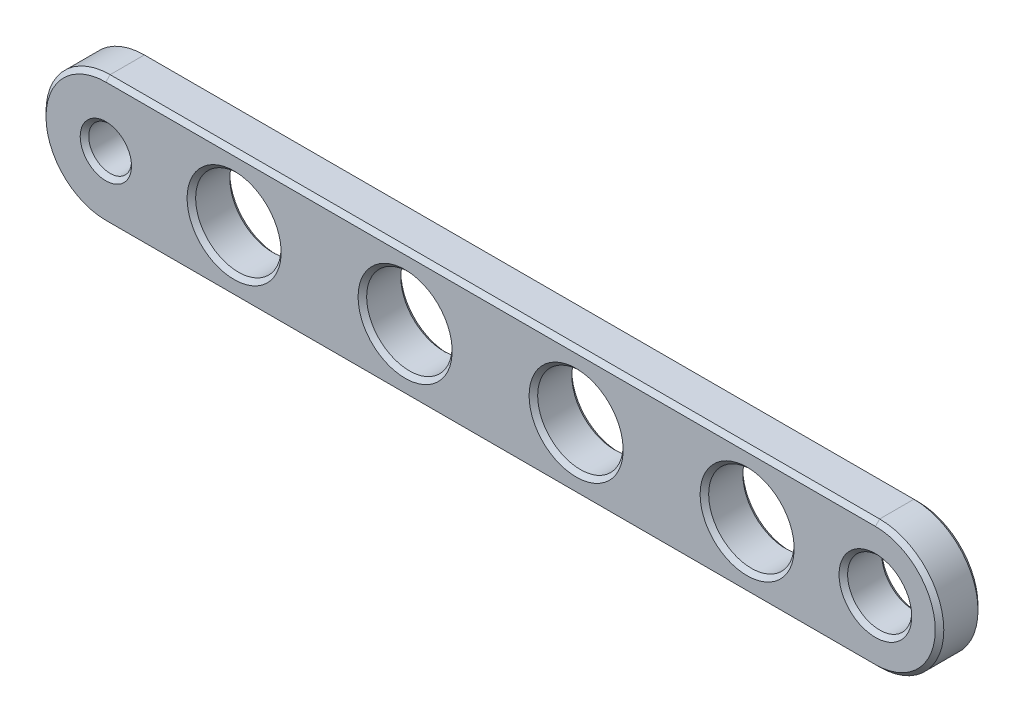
ISO-10303-21;
HEADER;
FILE_DESCRIPTION(('STEP AP214'),'2;1');
FILE_NAME('part.step','',(''),(''),'','','');
FILE_SCHEMA(('AUTOMOTIVE_DESIGN { 1 0 10303 214 1 1 1 1 }'));
ENDSEC;
DATA;
#1=APPLICATION_CONTEXT('core data for automotive mechanical design processes');
#2=APPLICATION_PROTOCOL_DEFINITION('international standard','automotive_design',2000,#1);
#3=PRODUCT_CONTEXT('',#1,'mechanical');
#4=PRODUCT('Part','Part','',(#3));
#5=PRODUCT_RELATED_PRODUCT_CATEGORY('part','',(#4));
#6=PRODUCT_DEFINITION_FORMATION('','',#4);
#7=PRODUCT_DEFINITION_CONTEXT('part definition',#1,'design');
#8=PRODUCT_DEFINITION('design','',#6,#7);
#9=PRODUCT_DEFINITION_SHAPE('','',#8);
#10=(LENGTH_UNIT() NAMED_UNIT(*) SI_UNIT(.MILLI.,.METRE.));
#11=(NAMED_UNIT(*) PLANE_ANGLE_UNIT() SI_UNIT($,.RADIAN.));
#12=(NAMED_UNIT(*) SI_UNIT($,.STERADIAN.) SOLID_ANGLE_UNIT());
#13=UNCERTAINTY_MEASURE_WITH_UNIT(LENGTH_MEASURE(1.E-05),#10,'distance_accuracy_value','');
#14=(GEOMETRIC_REPRESENTATION_CONTEXT(3) GLOBAL_UNCERTAINTY_ASSIGNED_CONTEXT((#13)) GLOBAL_UNIT_ASSIGNED_CONTEXT((#10,
#11,#12)) REPRESENTATION_CONTEXT('',''));
#15=CARTESIAN_POINT('',(0.,0.,0.));
#16=DIRECTION('',(0.,0.,1.));
#17=DIRECTION('',(1.,0.,0.));
#18=AXIS2_PLACEMENT_3D('',#15,#16,#17);
#19=CARTESIAN_POINT('',(18.6531645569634,0.,2.));
#20=DIRECTION('',(0.,0.,-1.));
#21=DIRECTION('',(-1.,0.,0.));
#22=AXIS2_PLACEMENT_3D('',#19,#20,#21);
#23=PLANE('',#22);
#24=CARTESIAN_POINT('',(12.6531645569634,0.,2.));
#25=DIRECTION('',(0.,0.,-1.));
#26=DIRECTION('',(-1.,0.,0.));
#27=AXIS2_PLACEMENT_3D('',#24,#25,#26);
#28=CIRCLE('',#27,2.19999999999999);
#29=CARTESIAN_POINT('',(10.4531645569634,0.,2.));
#30=VERTEX_POINT('',#29);
#31=EDGE_CURVE('E11',#30,#30,#28,.T.);
#32=ORIENTED_EDGE('',*,*,#31,.T.);
#33=EDGE_LOOP('',(#32));
#34=FACE_BOUND('',#33,.T.);
#35=CARTESIAN_POINT('',(4.65316455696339,0.,2.));
#36=DIRECTION('',(0.,0.,-1.));
#37=DIRECTION('',(-1.,0.,0.));
#38=AXIS2_PLACEMENT_3D('',#35,#36,#37);
#39=CIRCLE('',#38,2.19999999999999);
#40=CARTESIAN_POINT('',(2.4531645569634,0.,2.));
#41=VERTEX_POINT('',#40);
#42=EDGE_CURVE('E45',#41,#41,#39,.T.);
#43=ORIENTED_EDGE('',*,*,#42,.T.);
#44=EDGE_LOOP('',(#43));
#45=FACE_BOUND('',#44,.T.);
#46=CARTESIAN_POINT('',(-3.3468354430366,0.,2.));
#47=DIRECTION('',(0.,0.,-1.));
#48=DIRECTION('',(-1.,0.,0.));
#49=AXIS2_PLACEMENT_3D('',#46,#47,#48);
#50=CIRCLE('',#49,2.19999999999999);
#51=CARTESIAN_POINT('',(-5.5468354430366,0.,2.));
#52=VERTEX_POINT('',#51);
#53=EDGE_CURVE('E211',#52,#52,#50,.T.);
#54=ORIENTED_EDGE('',*,*,#53,.T.);
#55=EDGE_LOOP('',(#54));
#56=FACE_BOUND('',#55,.T.);
#57=CARTESIAN_POINT('',(-11.3468354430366,0.,2.));
#58=DIRECTION('',(0.,0.,-1.));
#59=DIRECTION('',(-1.,0.,0.));
#60=AXIS2_PLACEMENT_3D('',#57,#58,#59);
#61=CIRCLE('',#60,2.19999999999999);
#62=CARTESIAN_POINT('',(-13.5468354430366,0.,2.));
#63=VERTEX_POINT('',#62);
#64=EDGE_CURVE('E208',#63,#63,#61,.T.);
#65=ORIENTED_EDGE('',*,*,#64,.T.);
#66=EDGE_LOOP('',(#65));
#67=FACE_BOUND('',#66,.T.);
#68=CARTESIAN_POINT('',(18.6531645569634,0.,2.));
#69=DIRECTION('',(0.,0.,-1.));
#70=DIRECTION('',(-1.,0.,0.));
#71=AXIS2_PLACEMENT_3D('',#68,#69,#70);
#72=CIRCLE('',#71,1.69999999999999);
#73=CARTESIAN_POINT('',(16.9531645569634,0.,2.));
#74=VERTEX_POINT('',#73);
#75=EDGE_CURVE('E205',#74,#74,#72,.T.);
#76=ORIENTED_EDGE('',*,*,#75,.T.);
#77=EDGE_LOOP('',(#76));
#78=FACE_BOUND('',#77,.T.);
#79=CARTESIAN_POINT('',(-17.3468354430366,0.,2.));
#80=DIRECTION('',(0.,0.,-1.));
#81=DIRECTION('',(-1.,0.,0.));
#82=AXIS2_PLACEMENT_3D('',#79,#80,#81);
#83=CIRCLE('',#82,1.2);
#84=CARTESIAN_POINT('',(-18.5468354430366,0.,2.));
#85=VERTEX_POINT('',#84);
#86=EDGE_CURVE('E202',#85,#85,#83,.T.);
#87=ORIENTED_EDGE('',*,*,#86,.T.);
#88=EDGE_LOOP('',(#87));
#89=FACE_BOUND('',#88,.T.);
#90=CARTESIAN_POINT('',(-17.3468354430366,0.,2.));
#91=DIRECTION('',(0.,0.,-1.));
#92=DIRECTION('',(-1.,0.,0.));
#93=AXIS2_PLACEMENT_3D('',#90,#91,#92);
#94=CIRCLE('',#93,2.8);
#95=CARTESIAN_POINT('',(-17.3468354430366,2.8,2.));
#96=VERTEX_POINT('',#95);
#97=CARTESIAN_POINT('',(-17.3468354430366,-2.8,2.));
#98=VERTEX_POINT('',#97);
#99=EDGE_CURVE('E53',#96,#98,#94,.F.);
#100=ORIENTED_EDGE('',*,*,#99,.T.);
#101=DIRECTION('',(1.,0.,0.));
#102=VECTOR('',#101,1.);
#103=CARTESIAN_POINT('',(18.6531645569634,-2.8,2.));
#104=LINE('',#103,#102);
#105=CARTESIAN_POINT('',(18.6531645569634,-2.8,2.));
#106=VERTEX_POINT('',#105);
#107=EDGE_CURVE('E200',#98,#106,#104,.T.);
#108=ORIENTED_EDGE('',*,*,#107,.T.);
#109=CARTESIAN_POINT('',(18.6531645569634,0.,2.));
#110=DIRECTION('',(0.,0.,-1.));
#111=DIRECTION('',(-1.,0.,0.));
#112=AXIS2_PLACEMENT_3D('',#109,#110,#111);
#113=CIRCLE('',#112,2.8);
#114=CARTESIAN_POINT('',(18.6531645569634,2.8,2.));
#115=VERTEX_POINT('',#114);
#116=EDGE_CURVE('E196',#106,#115,#113,.F.);
#117=ORIENTED_EDGE('',*,*,#116,.T.);
#118=DIRECTION('',(-1.,0.,0.));
#119=VECTOR('',#118,1.);
#120=CARTESIAN_POINT('',(18.6531645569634,2.8,2.));
#121=LINE('',#120,#119);
#122=EDGE_CURVE('E58',#115,#96,#121,.T.);
#123=ORIENTED_EDGE('',*,*,#122,.T.);
#124=EDGE_LOOP('',(#100,#108,#117,#123));
#125=FACE_BOUND('',#124,.T.);
#126=ADVANCED_FACE('F35',(#34,#45,#56,#67,#78,#89,#125),#23,.F.);
#127=CARTESIAN_POINT('',(18.6531645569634,0.,0.));
#128=DIRECTION('',(0.,0.,-1.));
#129=DIRECTION('',(-1.,0.,0.));
#130=AXIS2_PLACEMENT_3D('',#127,#128,#129);
#131=PLANE('',#130);
#132=CARTESIAN_POINT('',(12.6531645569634,0.,0.));
#133=DIRECTION('',(0.,0.,-1.));
#134=DIRECTION('',(-1.,0.,0.));
#135=AXIS2_PLACEMENT_3D('',#132,#133,#134);
#136=CIRCLE('',#135,2.19999999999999);
#137=CARTESIAN_POINT('',(10.4531645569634,0.,0.));
#138=VERTEX_POINT('',#137);
#139=EDGE_CURVE('E141',#138,#138,#136,.F.);
#140=ORIENTED_EDGE('',*,*,#139,.T.);
#141=EDGE_LOOP('',(#140));
#142=FACE_BOUND('',#141,.T.);
#143=CARTESIAN_POINT('',(-3.3468354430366,0.,0.));
#144=DIRECTION('',(0.,0.,-1.));
#145=DIRECTION('',(-1.,0.,0.));
#146=AXIS2_PLACEMENT_3D('',#143,#144,#145);
#147=CIRCLE('',#146,2.2);
#148=CARTESIAN_POINT('',(-5.5468354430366,0.,0.));
#149=VERTEX_POINT('',#148);
#150=EDGE_CURVE('E134',#149,#149,#147,.F.);
#151=ORIENTED_EDGE('',*,*,#150,.T.);
#152=EDGE_LOOP('',(#151));
#153=FACE_BOUND('',#152,.T.);
#154=CARTESIAN_POINT('',(18.6531645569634,0.,0.));
#155=DIRECTION('',(0.,0.,-1.));
#156=DIRECTION('',(-1.,0.,0.));
#157=AXIS2_PLACEMENT_3D('',#154,#155,#156);
#158=CIRCLE('',#157,1.70000000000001);
#159=CARTESIAN_POINT('',(16.9531645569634,0.,0.));
#160=VERTEX_POINT('',#159);
#161=EDGE_CURVE('E131',#160,#160,#158,.F.);
#162=ORIENTED_EDGE('',*,*,#161,.T.);
#163=EDGE_LOOP('',(#162));
#164=FACE_BOUND('',#163,.T.);
#165=CARTESIAN_POINT('',(-17.3468354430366,0.,0.));
#166=DIRECTION('',(0.,0.,-1.));
#167=DIRECTION('',(-1.,0.,0.));
#168=AXIS2_PLACEMENT_3D('',#165,#166,#167);
#169=CIRCLE('',#168,2.8);
#170=CARTESIAN_POINT('',(-17.3468354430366,-2.80000000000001,0.));
#171=VERTEX_POINT('',#170);
#172=CARTESIAN_POINT('',(-17.3468354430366,2.8,0.));
#173=VERTEX_POINT('',#172);
#174=EDGE_CURVE('E130',#171,#173,#169,.T.);
#175=ORIENTED_EDGE('',*,*,#174,.T.);
#176=DIRECTION('',(1.,0.,0.));
#177=VECTOR('',#176,1.);
#178=CARTESIAN_POINT('',(18.6531645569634,2.8,0.));
#179=LINE('',#178,#177);
#180=CARTESIAN_POINT('',(18.6531645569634,2.8,0.));
#181=VERTEX_POINT('',#180);
#182=EDGE_CURVE('E108',#173,#181,#179,.T.);
#183=ORIENTED_EDGE('',*,*,#182,.T.);
#184=CARTESIAN_POINT('',(18.6531645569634,0.,0.));
#185=DIRECTION('',(0.,0.,-1.));
#186=DIRECTION('',(-1.,0.,0.));
#187=AXIS2_PLACEMENT_3D('',#184,#185,#186);
#188=CIRCLE('',#187,2.8);
#189=CARTESIAN_POINT('',(18.6531645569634,-2.80000000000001,0.));
#190=VERTEX_POINT('',#189);
#191=EDGE_CURVE('E118',#181,#190,#188,.T.);
#192=ORIENTED_EDGE('',*,*,#191,.T.);
#193=DIRECTION('',(-1.,0.,0.));
#194=VECTOR('',#193,1.);
#195=CARTESIAN_POINT('',(-17.3468354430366,-2.80000000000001,0.));
#196=LINE('',#195,#194);
#197=EDGE_CURVE('E124',#190,#171,#196,.T.);
#198=ORIENTED_EDGE('',*,*,#197,.T.);
#199=EDGE_LOOP('',(#175,#183,#192,#198));
#200=FACE_BOUND('',#199,.T.);
#201=CARTESIAN_POINT('',(-17.3468354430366,0.,0.));
#202=DIRECTION('',(0.,0.,-1.));
#203=DIRECTION('',(-1.,0.,0.));
#204=AXIS2_PLACEMENT_3D('',#201,#202,#203);
#205=CIRCLE('',#204,1.2);
#206=CARTESIAN_POINT('',(-18.5468354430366,0.,0.));
#207=VERTEX_POINT('',#206);
#208=EDGE_CURVE('E125',#207,#207,#205,.F.);
#209=ORIENTED_EDGE('',*,*,#208,.T.);
#210=EDGE_LOOP('',(#209));
#211=FACE_BOUND('',#210,.T.);
#212=CARTESIAN_POINT('',(-11.3468354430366,0.,0.));
#213=DIRECTION('',(0.,0.,-1.));
#214=DIRECTION('',(-1.,0.,0.));
#215=AXIS2_PLACEMENT_3D('',#212,#213,#214);
#216=CIRCLE('',#215,2.2);
#217=CARTESIAN_POINT('',(-13.5468354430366,0.,0.));
#218=VERTEX_POINT('',#217);
#219=EDGE_CURVE('E251',#218,#218,#216,.F.);
#220=ORIENTED_EDGE('',*,*,#219,.T.);
#221=EDGE_LOOP('',(#220));
#222=FACE_BOUND('',#221,.T.);
#223=CARTESIAN_POINT('',(4.65316455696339,0.,0.));
#224=DIRECTION('',(0.,0.,-1.));
#225=DIRECTION('',(-1.,0.,0.));
#226=AXIS2_PLACEMENT_3D('',#223,#224,#225);
#227=CIRCLE('',#226,2.2);
#228=CARTESIAN_POINT('',(2.4531645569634,0.,0.));
#229=VERTEX_POINT('',#228);
#230=EDGE_CURVE('E248',#229,#229,#227,.F.);
#231=ORIENTED_EDGE('',*,*,#230,.T.);
#232=EDGE_LOOP('',(#231));
#233=FACE_BOUND('',#232,.T.);
#234=ADVANCED_FACE('F127',(#142,#153,#164,#200,#211,#222,#233),#131,.T.);
#235=CARTESIAN_POINT('',(18.6531645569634,0.,2.));
#236=DIRECTION('',(0.,0.,-1.));
#237=DIRECTION('',(-1.,0.,0.));
#238=AXIS2_PLACEMENT_3D('',#235,#236,#237);
#239=CYLINDRICAL_SURFACE('',#238,3.);
#240=DIRECTION('',(0.,0.,-1.));
#241=VECTOR('',#240,1.);
#242=CARTESIAN_POINT('',(18.6531645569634,-3.,2.));
#243=LINE('',#242,#241);
#244=CARTESIAN_POINT('',(18.6531645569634,-3.,1.80000000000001));
#245=VERTEX_POINT('',#244);
#246=CARTESIAN_POINT('',(18.6531645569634,-3.,0.199999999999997));
#247=VERTEX_POINT('',#246);
#248=EDGE_CURVE('E220',#245,#247,#243,.T.);
#249=ORIENTED_EDGE('',*,*,#248,.T.);
#250=CARTESIAN_POINT('',(18.6531645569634,0.,0.199999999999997));
#251=DIRECTION('',(0.,0.,-1.));
#252=DIRECTION('',(-1.,0.,0.));
#253=AXIS2_PLACEMENT_3D('',#250,#251,#252);
#254=CIRCLE('',#253,3.);
#255=CARTESIAN_POINT('',(18.6531645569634,3.,0.199999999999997));
#256=VERTEX_POINT('',#255);
#257=EDGE_CURVE('E176',#247,#256,#254,.F.);
#258=ORIENTED_EDGE('',*,*,#257,.T.);
#259=DIRECTION('',(0.,0.,-1.));
#260=VECTOR('',#259,1.);
#261=CARTESIAN_POINT('',(18.6531645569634,3.,2.));
#262=LINE('',#261,#260);
#263=CARTESIAN_POINT('',(18.6531645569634,3.,1.80000000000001));
#264=VERTEX_POINT('',#263);
#265=EDGE_CURVE('E241',#264,#256,#262,.T.);
#266=ORIENTED_EDGE('',*,*,#265,.F.);
#267=CARTESIAN_POINT('',(18.6531645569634,0.,1.80000000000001));
#268=DIRECTION('',(0.,0.,-1.));
#269=DIRECTION('',(-1.,0.,0.));
#270=AXIS2_PLACEMENT_3D('',#267,#268,#269);
#271=CIRCLE('',#270,3.);
#272=EDGE_CURVE('E174',#264,#245,#271,.T.);
#273=ORIENTED_EDGE('',*,*,#272,.T.);
#274=EDGE_LOOP('',(#249,#258,#266,#273));
#275=FACE_BOUND('',#274,.T.);
#276=ADVANCED_FACE('F246',(#275),#239,.T.);
#277=CARTESIAN_POINT('',(-17.3468354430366,3.,2.));
#278=DIRECTION('',(0.,-1.,0.));
#279=DIRECTION('',(0.,0.,-1.));
#280=AXIS2_PLACEMENT_3D('',#277,#278,#279);
#281=PLANE('',#280);
#282=ORIENTED_EDGE('',*,*,#265,.T.);
#283=DIRECTION('',(-1.,0.,0.));
#284=VECTOR('',#283,1.);
#285=CARTESIAN_POINT('',(-17.3468354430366,3.,0.199999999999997));
#286=LINE('',#285,#284);
#287=CARTESIAN_POINT('',(-17.3468354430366,3.,0.199999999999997));
#288=VERTEX_POINT('',#287);
#289=EDGE_CURVE('E111',#256,#288,#286,.T.);
#290=ORIENTED_EDGE('',*,*,#289,.T.);
#291=DIRECTION('',(0.,0.,-1.));
#292=VECTOR('',#291,1.);
#293=CARTESIAN_POINT('',(-17.3468354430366,3.,2.));
#294=LINE('',#293,#292);
#295=CARTESIAN_POINT('',(-17.3468354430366,3.,1.80000000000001));
#296=VERTEX_POINT('',#295);
#297=EDGE_CURVE('E243',#296,#288,#294,.T.);
#298=ORIENTED_EDGE('',*,*,#297,.F.);
#299=DIRECTION('',(1.,0.,0.));
#300=VECTOR('',#299,1.);
#301=CARTESIAN_POINT('',(-17.3468354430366,3.,1.80000000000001));
#302=LINE('',#301,#300);
#303=EDGE_CURVE('E162',#296,#264,#302,.T.);
#304=ORIENTED_EDGE('',*,*,#303,.T.);
#305=EDGE_LOOP('',(#282,#290,#298,#304));
#306=FACE_BOUND('',#305,.T.);
#307=ADVANCED_FACE('F240',(#306),#281,.F.);
#308=CARTESIAN_POINT('',(-17.3468354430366,0.,2.));
#309=DIRECTION('',(0.,0.,-1.));
#310=DIRECTION('',(-1.,0.,0.));
#311=AXIS2_PLACEMENT_3D('',#308,#309,#310);
#312=CYLINDRICAL_SURFACE('',#311,3.);
#313=ORIENTED_EDGE('',*,*,#297,.T.);
#314=CARTESIAN_POINT('',(-17.3468354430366,0.,0.199999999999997));
#315=DIRECTION('',(0.,0.,-1.));
#316=DIRECTION('',(-1.,0.,0.));
#317=AXIS2_PLACEMENT_3D('',#314,#315,#316);
#318=CIRCLE('',#317,3.);
#319=CARTESIAN_POINT('',(-17.3468354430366,-3.,0.199999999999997));
#320=VERTEX_POINT('',#319);
#321=EDGE_CURVE('E167',#288,#320,#318,.F.);
#322=ORIENTED_EDGE('',*,*,#321,.T.);
#323=DIRECTION('',(0.,0.,-1.));
#324=VECTOR('',#323,1.);
#325=CARTESIAN_POINT('',(-17.3468354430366,-3.,2.));
#326=LINE('',#325,#324);
#327=CARTESIAN_POINT('',(-17.3468354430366,-3.,1.80000000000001));
#328=VERTEX_POINT('',#327);
#329=EDGE_CURVE('E253',#328,#320,#326,.T.);
#330=ORIENTED_EDGE('',*,*,#329,.F.);
#331=CARTESIAN_POINT('',(-17.3468354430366,0.,1.80000000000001));
#332=DIRECTION('',(0.,0.,-1.));
#333=DIRECTION('',(-1.,0.,0.));
#334=AXIS2_PLACEMENT_3D('',#331,#332,#333);
#335=CIRCLE('',#334,3.);
#336=EDGE_CURVE('E165',#328,#296,#335,.T.);
#337=ORIENTED_EDGE('',*,*,#336,.T.);
#338=EDGE_LOOP('',(#313,#322,#330,#337));
#339=FACE_BOUND('',#338,.T.);
#340=ADVANCED_FACE('F270',(#339),#312,.T.);
#341=CARTESIAN_POINT('',(-17.3468354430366,-3.,2.));
#342=DIRECTION('',(0.,1.,0.));
#343=DIRECTION('',(0.,0.,1.));
#344=AXIS2_PLACEMENT_3D('',#341,#342,#343);
#345=PLANE('',#344);
#346=ORIENTED_EDGE('',*,*,#329,.T.);
#347=DIRECTION('',(1.,0.,0.));
#348=VECTOR('',#347,1.);
#349=CARTESIAN_POINT('',(18.6531645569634,-3.,0.199999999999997));
#350=LINE('',#349,#348);
#351=EDGE_CURVE('E172',#320,#247,#350,.T.);
#352=ORIENTED_EDGE('',*,*,#351,.T.);
#353=ORIENTED_EDGE('',*,*,#248,.F.);
#354=DIRECTION('',(-1.,0.,0.));
#355=VECTOR('',#354,1.);
#356=CARTESIAN_POINT('',(-17.3468354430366,-3.,1.80000000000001));
#357=LINE('',#356,#355);
#358=EDGE_CURVE('E169',#245,#328,#357,.T.);
#359=ORIENTED_EDGE('',*,*,#358,.T.);
#360=EDGE_LOOP('',(#346,#352,#353,#359));
#361=FACE_BOUND('',#360,.T.);
#362=ADVANCED_FACE('F274',(#361),#345,.F.);
#363=CARTESIAN_POINT('',(-17.3468354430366,0.,2.));
#364=DIRECTION('',(0.,0.,-1.));
#365=DIRECTION('',(-1.,0.,0.));
#366=AXIS2_PLACEMENT_3D('',#363,#364,#365);
#367=CYLINDRICAL_SURFACE('',#366,1.);
#368=CARTESIAN_POINT('',(-17.3468354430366,0.,0.199999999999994));
#369=DIRECTION('',(0.,0.,-1.));
#370=DIRECTION('',(-1.,0.,0.));
#371=AXIS2_PLACEMENT_3D('',#368,#369,#370);
#372=CIRCLE('',#371,1.);
#373=CARTESIAN_POINT('',(-18.3468354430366,0.,0.199999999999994));
#374=VERTEX_POINT('',#373);
#375=EDGE_CURVE('E181',#374,#374,#372,.T.);
#376=ORIENTED_EDGE('',*,*,#375,.T.);
#377=EDGE_LOOP('',(#376));
#378=FACE_BOUND('',#377,.T.);
#379=CARTESIAN_POINT('',(-17.3468354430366,0.,1.8));
#380=DIRECTION('',(0.,0.,-1.));
#381=DIRECTION('',(-1.,0.,0.));
#382=AXIS2_PLACEMENT_3D('',#379,#380,#381);
#383=CIRCLE('',#382,1.);
#384=CARTESIAN_POINT('',(-18.3468354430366,0.,1.8));
#385=VERTEX_POINT('',#384);
#386=EDGE_CURVE('E178',#385,#385,#383,.F.);
#387=ORIENTED_EDGE('',*,*,#386,.T.);
#388=EDGE_LOOP('',(#387));
#389=FACE_BOUND('',#388,.T.);
#390=ADVANCED_FACE('F290',(#378,#389),#367,.F.);
#391=CARTESIAN_POINT('',(18.6531645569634,0.,2.));
#392=DIRECTION('',(0.,0.,-1.));
#393=DIRECTION('',(-1.,0.,0.));
#394=AXIS2_PLACEMENT_3D('',#391,#392,#393);
#395=CYLINDRICAL_SURFACE('',#394,1.5);
#396=CARTESIAN_POINT('',(18.6531645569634,0.,0.200000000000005));
#397=DIRECTION('',(0.,0.,-1.));
#398=DIRECTION('',(-1.,0.,0.));
#399=AXIS2_PLACEMENT_3D('',#396,#397,#398);
#400=CIRCLE('',#399,1.5);
#401=CARTESIAN_POINT('',(17.1531645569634,0.,0.200000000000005));
#402=VERTEX_POINT('',#401);
#403=EDGE_CURVE('E159',#402,#402,#400,.T.);
#404=CARTESIAN_POINT('',(18.6531645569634,0.,1.80000000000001));
#405=DIRECTION('',(0.,0.,-1.));
#406=DIRECTION('',(-1.,0.,0.));
#407=AXIS2_PLACEMENT_3D('',#404,#405,#406);
#408=CIRCLE('',#407,1.5);
#409=CARTESIAN_POINT('',(17.1531645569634,0.,1.80000000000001));
#410=VERTEX_POINT('',#409);
#411=EDGE_CURVE('E156',#410,#410,#408,.F.);
#412=CARTESIAN_POINT('',(17.1531645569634,0.,0.200000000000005));
#413=CARTESIAN_POINT('',(17.1531645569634,0.,0.216666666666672));
#414=CARTESIAN_POINT('',(17.1531645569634,0.,0.233333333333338));
#415=CARTESIAN_POINT('',(17.1531645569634,0.,0.266666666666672));
#416=CARTESIAN_POINT('',(17.1531645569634,0.,0.283333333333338));
#417=CARTESIAN_POINT('',(17.1531645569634,0.,0.316666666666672));
#418=CARTESIAN_POINT('',(17.1531645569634,0.,0.333333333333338));
#419=CARTESIAN_POINT('',(17.1531645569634,0.,0.366666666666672));
#420=CARTESIAN_POINT('',(17.1531645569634,0.,0.383333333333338));
#421=CARTESIAN_POINT('',(17.1531645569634,0.,0.416666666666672));
#422=CARTESIAN_POINT('',(17.1531645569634,0.,0.433333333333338));
#423=CARTESIAN_POINT('',(17.1531645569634,0.,0.466666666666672));
#424=CARTESIAN_POINT('',(17.1531645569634,0.,0.483333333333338));
#425=CARTESIAN_POINT('',(17.1531645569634,0.,0.516666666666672));
#426=CARTESIAN_POINT('',(17.1531645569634,0.,0.533333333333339));
#427=CARTESIAN_POINT('',(17.1531645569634,0.,0.566666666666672));
#428=CARTESIAN_POINT('',(17.1531645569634,0.,0.583333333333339));
#429=CARTESIAN_POINT('',(17.1531645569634,0.,0.616666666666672));
#430=CARTESIAN_POINT('',(17.1531645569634,0.,0.633333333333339));
#431=CARTESIAN_POINT('',(17.1531645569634,0.,0.666666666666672));
#432=CARTESIAN_POINT('',(17.1531645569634,0.,0.683333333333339));
#433=CARTESIAN_POINT('',(17.1531645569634,0.,0.716666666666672));
#434=CARTESIAN_POINT('',(17.1531645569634,0.,0.733333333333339));
#435=CARTESIAN_POINT('',(17.1531645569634,0.,0.766666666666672));
#436=CARTESIAN_POINT('',(17.1531645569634,0.,0.783333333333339));
#437=CARTESIAN_POINT('',(17.1531645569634,0.,0.816666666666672));
#438=CARTESIAN_POINT('',(17.1531645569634,0.,0.833333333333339));
#439=CARTESIAN_POINT('',(17.1531645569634,0.,0.866666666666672));
#440=CARTESIAN_POINT('',(17.1531645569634,0.,0.883333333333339));
#441=CARTESIAN_POINT('',(17.1531645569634,0.,0.916666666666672));
#442=CARTESIAN_POINT('',(17.1531645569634,0.,0.933333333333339));
#443=CARTESIAN_POINT('',(17.1531645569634,0.,0.966666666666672));
#444=CARTESIAN_POINT('',(17.1531645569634,0.,0.983333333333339));
#445=CARTESIAN_POINT('',(17.1531645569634,0.,1.01666666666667));
#446=CARTESIAN_POINT('',(17.1531645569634,0.,1.03333333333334));
#447=CARTESIAN_POINT('',(17.1531645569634,0.,1.06666666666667));
#448=CARTESIAN_POINT('',(17.1531645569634,0.,1.08333333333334));
#449=CARTESIAN_POINT('',(17.1531645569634,0.,1.11666666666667));
#450=CARTESIAN_POINT('',(17.1531645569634,0.,1.13333333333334));
#451=CARTESIAN_POINT('',(17.1531645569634,0.,1.16666666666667));
#452=CARTESIAN_POINT('',(17.1531645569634,0.,1.18333333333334));
#453=CARTESIAN_POINT('',(17.1531645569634,0.,1.21666666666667));
#454=CARTESIAN_POINT('',(17.1531645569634,0.,1.23333333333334));
#455=CARTESIAN_POINT('',(17.1531645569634,0.,1.26666666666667));
#456=CARTESIAN_POINT('',(17.1531645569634,0.,1.28333333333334));
#457=CARTESIAN_POINT('',(17.1531645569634,0.,1.31666666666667));
#458=CARTESIAN_POINT('',(17.1531645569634,0.,1.33333333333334));
#459=CARTESIAN_POINT('',(17.1531645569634,0.,1.36666666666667));
#460=CARTESIAN_POINT('',(17.1531645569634,0.,1.38333333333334));
#461=CARTESIAN_POINT('',(17.1531645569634,0.,1.41666666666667));
#462=CARTESIAN_POINT('',(17.1531645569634,0.,1.43333333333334));
#463=CARTESIAN_POINT('',(17.1531645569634,0.,1.46666666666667));
#464=CARTESIAN_POINT('',(17.1531645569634,0.,1.48333333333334));
#465=CARTESIAN_POINT('',(17.1531645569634,0.,1.51666666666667));
#466=CARTESIAN_POINT('',(17.1531645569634,0.,1.53333333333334));
#467=CARTESIAN_POINT('',(17.1531645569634,0.,1.56666666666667));
#468=CARTESIAN_POINT('',(17.1531645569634,0.,1.58333333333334));
#469=CARTESIAN_POINT('',(17.1531645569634,0.,1.61666666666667));
#470=CARTESIAN_POINT('',(17.1531645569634,0.,1.63333333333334));
#471=CARTESIAN_POINT('',(17.1531645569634,0.,1.66666666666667));
#472=CARTESIAN_POINT('',(17.1531645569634,0.,1.68333333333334));
#473=CARTESIAN_POINT('',(17.1531645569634,0.,1.71666666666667));
#474=CARTESIAN_POINT('',(17.1531645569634,0.,1.73333333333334));
#475=CARTESIAN_POINT('',(17.1531645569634,0.,1.76666666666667));
#476=CARTESIAN_POINT('',(17.1531645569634,0.,1.78333333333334));
#477=CARTESIAN_POINT('',(17.1531645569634,0.,1.80000000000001));
#478=B_SPLINE_CURVE_WITH_KNOTS('',3,(#412,#413,#414,#415,#416,#417,#418,#419,#420,#421,#422,
#423,#424,#425,#426,#427,#428,#429,#430,#431,#432,#433,#434,#435,#436,#437,#438,#439,#440,#441,
#442,#443,#444,#445,#446,#447,#448,#449,#450,#451,#452,#453,#454,#455,#456,#457,#458,#459,#460,
#461,#462,#463,#464,#465,#466,#467,#468,#469,#470,#471,#472,#473,#474,#475,#476,#477),
.UNSPECIFIED.,.F.,.F.,(4,2,2,2,2,2,2,2,2,2,2,2,2,2,2,2,2,2,2,2,2,2,2,2,2,2,2,2,2,2,2,2,4),(0.,
0.0500000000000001,0.1,0.15,0.2,0.25,0.3,0.35,0.4,0.45,0.5,0.550000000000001,0.600000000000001,
0.650000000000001,0.700000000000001,0.750000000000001,0.800000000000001,0.850000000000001,
0.900000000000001,0.950000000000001,1.,1.05,1.1,1.15,1.2,1.25,1.3,1.35,1.4,1.45,1.5,1.55,1.6),.UNSPECIFIED.);
#479=EDGE_CURVE('BSEAM518',#402,#410,#478,.T.);
#480=ORIENTED_EDGE('',*,*,#403,.T.);
#481=ORIENTED_EDGE('',*,*,#411,.T.);
#482=ORIENTED_EDGE('',*,*,#479,.T.);
#483=ORIENTED_EDGE('',*,*,#479,.F.);
#484=EDGE_LOOP('',(#480,#482,#481,#483));
#485=FACE_BOUND('',#484,.T.);
#486=ADVANCED_FACE('F518',(#485),#395,.F.);
#487=CARTESIAN_POINT('',(-11.3468354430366,0.,2.));
#488=DIRECTION('',(0.,0.,-1.));
#489=DIRECTION('',(-1.,0.,0.));
#490=AXIS2_PLACEMENT_3D('',#487,#488,#489);
#491=CYLINDRICAL_SURFACE('',#490,2.);
#492=CARTESIAN_POINT('',(-11.3468354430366,0.,0.200000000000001));
#493=DIRECTION('',(0.,0.,-1.));
#494=DIRECTION('',(-1.,0.,0.));
#495=AXIS2_PLACEMENT_3D('',#492,#493,#494);
#496=CIRCLE('',#495,2.);
#497=CARTESIAN_POINT('',(-13.3468354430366,0.,0.200000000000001));
#498=VERTEX_POINT('',#497);
#499=EDGE_CURVE('E187',#498,#498,#496,.T.);
#500=ORIENTED_EDGE('',*,*,#499,.T.);
#501=EDGE_LOOP('',(#500));
#502=FACE_BOUND('',#501,.T.);
#503=CARTESIAN_POINT('',(-11.3468354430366,0.,1.80000000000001));
#504=DIRECTION('',(0.,0.,-1.));
#505=DIRECTION('',(-1.,0.,0.));
#506=AXIS2_PLACEMENT_3D('',#503,#504,#505);
#507=CIRCLE('',#506,2.);
#508=CARTESIAN_POINT('',(-13.3468354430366,0.,1.80000000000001));
#509=VERTEX_POINT('',#508);
#510=EDGE_CURVE('E184',#509,#509,#507,.F.);
#511=ORIENTED_EDGE('',*,*,#510,.T.);
#512=EDGE_LOOP('',(#511));
#513=FACE_BOUND('',#512,.T.);
#514=ADVANCED_FACE('F510',(#502,#513),#491,.F.);
#515=CARTESIAN_POINT('',(-3.3468354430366,0.,2.));
#516=DIRECTION('',(0.,0.,-1.));
#517=DIRECTION('',(-1.,0.,0.));
#518=AXIS2_PLACEMENT_3D('',#515,#516,#517);
#519=CYLINDRICAL_SURFACE('',#518,2.);
#520=CARTESIAN_POINT('',(-3.3468354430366,0.,0.199999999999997));
#521=DIRECTION('',(0.,0.,-1.));
#522=DIRECTION('',(-1.,0.,0.));
#523=AXIS2_PLACEMENT_3D('',#520,#521,#522);
#524=CIRCLE('',#523,2.);
#525=CARTESIAN_POINT('',(-5.3468354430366,0.,0.199999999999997));
#526=VERTEX_POINT('',#525);
#527=EDGE_CURVE('E153',#526,#526,#524,.T.);
#528=ORIENTED_EDGE('',*,*,#527,.T.);
#529=EDGE_LOOP('',(#528));
#530=FACE_BOUND('',#529,.T.);
#531=CARTESIAN_POINT('',(-3.3468354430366,0.,1.80000000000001));
#532=DIRECTION('',(0.,0.,-1.));
#533=DIRECTION('',(-1.,0.,0.));
#534=AXIS2_PLACEMENT_3D('',#531,#532,#533);
#535=CIRCLE('',#534,2.);
#536=CARTESIAN_POINT('',(-5.3468354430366,0.,1.80000000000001));
#537=VERTEX_POINT('',#536);
#538=EDGE_CURVE('E150',#537,#537,#535,.F.);
#539=ORIENTED_EDGE('',*,*,#538,.T.);
#540=EDGE_LOOP('',(#539));
#541=FACE_BOUND('',#540,.T.);
#542=ADVANCED_FACE('F502',(#530,#541),#519,.F.);
#543=CARTESIAN_POINT('',(4.65316455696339,0.,2.));
#544=DIRECTION('',(0.,0.,-1.));
#545=DIRECTION('',(-1.,0.,0.));
#546=AXIS2_PLACEMENT_3D('',#543,#544,#545);
#547=CYLINDRICAL_SURFACE('',#546,2.);
#548=CARTESIAN_POINT('',(4.65316455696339,0.,0.199999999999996));
#549=DIRECTION('',(0.,0.,-1.));
#550=DIRECTION('',(-1.,0.,0.));
#551=AXIS2_PLACEMENT_3D('',#548,#549,#550);
#552=CIRCLE('',#551,2.);
#553=CARTESIAN_POINT('',(2.65316455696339,0.,0.199999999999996));
#554=VERTEX_POINT('',#553);
#555=EDGE_CURVE('E193',#554,#554,#552,.T.);
#556=ORIENTED_EDGE('',*,*,#555,.T.);
#557=EDGE_LOOP('',(#556));
#558=FACE_BOUND('',#557,.T.);
#559=CARTESIAN_POINT('',(4.65316455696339,0.,1.80000000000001));
#560=DIRECTION('',(0.,0.,-1.));
#561=DIRECTION('',(-1.,0.,0.));
#562=AXIS2_PLACEMENT_3D('',#559,#560,#561);
#563=CIRCLE('',#562,2.);
#564=CARTESIAN_POINT('',(2.65316455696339,0.,1.80000000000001));
#565=VERTEX_POINT('',#564);
#566=EDGE_CURVE('E190',#565,#565,#563,.F.);
#567=ORIENTED_EDGE('',*,*,#566,.T.);
#568=EDGE_LOOP('',(#567));
#569=FACE_BOUND('',#568,.T.);
#570=ADVANCED_FACE('F494',(#558,#569),#547,.F.);
#571=CARTESIAN_POINT('',(12.6531645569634,0.,2.));
#572=DIRECTION('',(0.,0.,-1.));
#573=DIRECTION('',(-1.,0.,0.));
#574=AXIS2_PLACEMENT_3D('',#571,#572,#573);
#575=CYLINDRICAL_SURFACE('',#574,2.);
#576=CARTESIAN_POINT('',(12.6531645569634,0.,0.199999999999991));
#577=DIRECTION('',(0.,0.,-1.));
#578=DIRECTION('',(-1.,0.,0.));
#579=AXIS2_PLACEMENT_3D('',#576,#577,#578);
#580=CIRCLE('',#579,2.);
#581=CARTESIAN_POINT('',(10.6531645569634,0.,0.199999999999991));
#582=VERTEX_POINT('',#581);
#583=EDGE_CURVE('E147',#582,#582,#580,.T.);
#584=ORIENTED_EDGE('',*,*,#583,.T.);
#585=EDGE_LOOP('',(#584));
#586=FACE_BOUND('',#585,.T.);
#587=CARTESIAN_POINT('',(12.6531645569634,0.,1.80000000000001));
#588=DIRECTION('',(0.,0.,-1.));
#589=DIRECTION('',(-1.,0.,0.));
#590=AXIS2_PLACEMENT_3D('',#587,#588,#589);
#591=CIRCLE('',#590,2.);
#592=CARTESIAN_POINT('',(10.6531645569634,0.,1.80000000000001));
#593=VERTEX_POINT('',#592);
#594=EDGE_CURVE('E144',#593,#593,#591,.F.);
#595=ORIENTED_EDGE('',*,*,#594,.T.);
#596=EDGE_LOOP('',(#595));
#597=FACE_BOUND('',#596,.T.);
#598=ADVANCED_FACE('F309',(#586,#597),#575,.F.);
#599=CARTESIAN_POINT('',(12.6531645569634,0.,0.));
#600=DIRECTION('',(0.,0.,-1.));
#601=DIRECTION('',(-1.,0.,0.));
#602=AXIS2_PLACEMENT_3D('',#599,#600,#601);
#603=CONICAL_SURFACE('',#602,2.19999999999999,0.785398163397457);
#604=ORIENTED_EDGE('',*,*,#583,.F.);
#605=EDGE_LOOP('',(#604));
#606=FACE_BOUND('',#605,.T.);
#607=ORIENTED_EDGE('',*,*,#139,.F.);
#608=EDGE_LOOP('',(#607));
#609=FACE_BOUND('',#608,.T.);
#610=ADVANCED_FACE('F302',(#606,#609),#603,.F.);
#611=CARTESIAN_POINT('',(-3.3468354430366,0.,0.));
#612=DIRECTION('',(0.,0.,-1.));
#613=DIRECTION('',(-1.,0.,0.));
#614=AXIS2_PLACEMENT_3D('',#611,#612,#613);
#615=CONICAL_SURFACE('',#614,2.2,0.785398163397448);
#616=ORIENTED_EDGE('',*,*,#527,.F.);
#617=EDGE_LOOP('',(#616));
#618=FACE_BOUND('',#617,.T.);
#619=ORIENTED_EDGE('',*,*,#150,.F.);
#620=EDGE_LOOP('',(#619));
#621=FACE_BOUND('',#620,.T.);
#622=ADVANCED_FACE('F308',(#618,#621),#615,.F.);
#623=CARTESIAN_POINT('',(18.6531645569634,0.,0.));
#624=DIRECTION('',(0.,0.,-1.));
#625=DIRECTION('',(-1.,0.,0.));
#626=AXIS2_PLACEMENT_3D('',#623,#624,#625);
#627=CONICAL_SURFACE('',#626,1.70000000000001,0.785398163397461);
#628=CARTESIAN_POINT('',(17.1531645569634,0.,0.200000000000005));
#629=CARTESIAN_POINT('',(17.1510812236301,0.,0.197916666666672));
#630=CARTESIAN_POINT('',(17.1489978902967,0.,0.195833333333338));
#631=CARTESIAN_POINT('',(17.1448312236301,0.,0.191666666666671));
#632=CARTESIAN_POINT('',(17.1427478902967,0.,0.189583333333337));
#633=CARTESIAN_POINT('',(17.1385812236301,0.,0.185416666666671));
#634=CARTESIAN_POINT('',(17.1364978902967,0.,0.183333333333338));
#635=CARTESIAN_POINT('',(17.1323312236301,0.,0.179166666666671));
#636=CARTESIAN_POINT('',(17.1302478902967,0.,0.177083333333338));
#637=CARTESIAN_POINT('',(17.1260812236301,0.,0.172916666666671));
#638=CARTESIAN_POINT('',(17.1239978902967,0.,0.170833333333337));
#639=CARTESIAN_POINT('',(17.1198312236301,0.,0.16666666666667));
#640=CARTESIAN_POINT('',(17.1177478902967,0.,0.164583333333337));
#641=CARTESIAN_POINT('',(17.1135812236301,0.,0.16041666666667));
#642=CARTESIAN_POINT('',(17.1114978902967,0.,0.158333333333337));
#643=CARTESIAN_POINT('',(17.1073312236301,0.,0.154166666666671));
#644=CARTESIAN_POINT('',(17.1052478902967,0.,0.152083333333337));
#645=CARTESIAN_POINT('',(17.1010812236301,0.,0.14791666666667));
#646=CARTESIAN_POINT('',(17.0989978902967,0.,0.145833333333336));
#647=CARTESIAN_POINT('',(17.0948312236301,0.,0.14166666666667));
#648=CARTESIAN_POINT('',(17.0927478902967,0.,0.139583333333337));
#649=CARTESIAN_POINT('',(17.0885812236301,0.,0.13541666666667));
#650=CARTESIAN_POINT('',(17.0864978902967,0.,0.133333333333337));
#651=CARTESIAN_POINT('',(17.0823312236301,0.,0.129166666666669));
#652=CARTESIAN_POINT('',(17.0802478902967,0.,0.127083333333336));
#653=CARTESIAN_POINT('',(17.0760812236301,0.,0.122916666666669));
#654=CARTESIAN_POINT('',(17.0739978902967,0.,0.120833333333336));
#655=CARTESIAN_POINT('',(17.0698312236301,0.,0.11666666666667));
#656=CARTESIAN_POINT('',(17.0677478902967,0.,0.114583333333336));
#657=CARTESIAN_POINT('',(17.0635812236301,0.,0.110416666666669));
#658=CARTESIAN_POINT('',(17.0614978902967,0.,0.108333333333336));
#659=CARTESIAN_POINT('',(17.0573312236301,0.,0.104166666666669));
#660=CARTESIAN_POINT('',(17.0552478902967,0.,0.102083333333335));
#661=CARTESIAN_POINT('',(17.0510812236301,0.,0.0979166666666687));
#662=CARTESIAN_POINT('',(17.0489978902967,0.,0.0958333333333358));
#663=CARTESIAN_POINT('',(17.0448312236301,0.,0.0916666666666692));
#664=CARTESIAN_POINT('',(17.0427478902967,0.,0.0895833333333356));
#665=CARTESIAN_POINT('',(17.0385812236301,0.,0.0854166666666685));
#666=CARTESIAN_POINT('',(17.0364978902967,0.,0.0833333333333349));
#667=CARTESIAN_POINT('',(17.0323312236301,0.,0.0791666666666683));
#668=CARTESIAN_POINT('',(17.0302478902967,0.,0.0770833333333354));
#669=CARTESIAN_POINT('',(17.0260812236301,0.,0.0729166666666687));
#670=CARTESIAN_POINT('',(17.0239978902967,0.,0.0708333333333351));
#671=CARTESIAN_POINT('',(17.0198312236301,0.,0.0666666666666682));
#672=CARTESIAN_POINT('',(17.0177478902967,0.,0.0645833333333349));
#673=CARTESIAN_POINT('',(17.0135812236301,0.,0.060416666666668));
#674=CARTESIAN_POINT('',(17.0114978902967,0.,0.0583333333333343));
#675=CARTESIAN_POINT('',(17.0073312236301,0.,0.0541666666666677));
#676=CARTESIAN_POINT('',(17.0052478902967,0.,0.0520833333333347));
#677=CARTESIAN_POINT('',(17.0010812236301,0.,0.0479166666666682));
#678=CARTESIAN_POINT('',(16.9989978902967,0.,0.0458333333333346));
#679=CARTESIAN_POINT('',(16.9948312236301,0.,0.0416666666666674));
#680=CARTESIAN_POINT('',(16.9927478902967,0.,0.0395833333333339));
#681=CARTESIAN_POINT('',(16.9885812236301,0.,0.0354166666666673));
#682=CARTESIAN_POINT('',(16.9864978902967,0.,0.0333333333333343));
#683=CARTESIAN_POINT('',(16.9823312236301,0.,0.0291666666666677));
#684=CARTESIAN_POINT('',(16.9802478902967,0.,0.027083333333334));
#685=CARTESIAN_POINT('',(16.9760812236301,0.,0.0229166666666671));
#686=CARTESIAN_POINT('',(16.9739978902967,0.,0.0208333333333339));
#687=CARTESIAN_POINT('',(16.9698312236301,0.,0.016666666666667));
#688=CARTESIAN_POINT('',(16.9677478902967,0.,0.0145833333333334));
#689=CARTESIAN_POINT('',(16.9635812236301,0.,0.0104166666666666));
#690=CARTESIAN_POINT('',(16.9614978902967,0.,0.00833333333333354));
#691=CARTESIAN_POINT('',(16.95733122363,0.,0.00416666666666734));
#692=CARTESIAN_POINT('',(16.9552478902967,0.,0.00208333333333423));
#693=CARTESIAN_POINT('',(16.9531645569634,0.,0.));
#694=B_SPLINE_CURVE_WITH_KNOTS('',3,(#628,#629,#630,#631,#632,#633,#634,#635,#636,#637,#638,
#639,#640,#641,#642,#643,#644,#645,#646,#647,#648,#649,#650,#651,#652,#653,#654,#655,#656,#657,
#658,#659,#660,#661,#662,#663,#664,#665,#666,#667,#668,#669,#670,#671,#672,#673,#674,#675,#676,
#677,#678,#679,#680,#681,#682,#683,#684,#685,#686,#687,#688,#689,#690,#691,#692,#693),
.UNSPECIFIED.,.F.,.F.,(4,2,2,2,2,2,2,2,2,2,2,2,2,2,2,2,2,2,2,2,2,2,2,2,2,2,2,2,2,2,2,2,4),(0.,
0.00883883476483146,0.0176776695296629,0.0265165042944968,0.0353553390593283,0.0441941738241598,
0.0530330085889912,0.0618718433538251,0.0707106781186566,0.079549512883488,0.088388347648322,
0.0972271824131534,0.106066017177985,0.114904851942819,0.12374368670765,0.132582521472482,
0.141421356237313,0.150260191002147,0.159099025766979,0.16793786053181,0.176776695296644,
0.185615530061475,0.194454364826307,0.203293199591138,0.212132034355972,0.220970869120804,
0.229809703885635,0.238648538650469,0.247487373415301,0.256326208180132,0.265165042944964,
0.274003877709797,0.282842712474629),.UNSPECIFIED.);
#695=EDGE_CURVE('BSEAM316',#402,#160,#694,.T.);
#696=ORIENTED_EDGE('',*,*,#403,.F.);
#697=ORIENTED_EDGE('',*,*,#161,.F.);
#698=ORIENTED_EDGE('',*,*,#695,.T.);
#699=ORIENTED_EDGE('',*,*,#695,.F.);
#700=EDGE_LOOP('',(#696,#698,#697,#699));
#701=FACE_BOUND('',#700,.T.);
#702=ADVANCED_FACE('F316',(#701),#627,.F.);
#703=CARTESIAN_POINT('',(-17.3468354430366,-3.,0.199999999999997));
#704=DIRECTION('',(0.,-0.70710678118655,-0.707106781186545));
#705=DIRECTION('',(-1.,0.,0.));
#706=AXIS2_PLACEMENT_3D('',#703,#704,#705);
#707=PLANE('',#706);
#708=DIRECTION('',(0.,-0.707106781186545,0.70710678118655));
#709=VECTOR('',#708,1.);
#710=CARTESIAN_POINT('',(-17.3468354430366,-2.80000000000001,0.));
#711=LINE('',#710,#709);
#712=EDGE_CURVE('E114',#171,#320,#711,.T.);
#713=ORIENTED_EDGE('',*,*,#712,.F.);
#714=ORIENTED_EDGE('',*,*,#197,.F.);
#715=DIRECTION('',(0.,0.707106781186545,-0.70710678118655));
#716=VECTOR('',#715,1.);
#717=CARTESIAN_POINT('',(18.6531645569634,-3.,0.199999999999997));
#718=LINE('',#717,#716);
#719=EDGE_CURVE('E121',#247,#190,#718,.T.);
#720=ORIENTED_EDGE('',*,*,#719,.F.);
#721=ORIENTED_EDGE('',*,*,#351,.F.);
#722=EDGE_LOOP('',(#713,#714,#720,#721));
#723=FACE_BOUND('',#722,.T.);
#724=ADVANCED_FACE('F263',(#723),#707,.T.);
#725=CARTESIAN_POINT('',(18.6531645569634,0.,0.199999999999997));
#726=DIRECTION('',(0.,0.,1.));
#727=DIRECTION('',(1.,0.,0.));
#728=AXIS2_PLACEMENT_3D('',#725,#726,#727);
#729=CONICAL_SURFACE('',#728,3.,0.785398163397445);
#730=ORIENTED_EDGE('',*,*,#719,.T.);
#731=ORIENTED_EDGE('',*,*,#191,.F.);
#732=DIRECTION('',(0.,-0.707106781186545,-0.70710678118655));
#733=VECTOR('',#732,1.);
#734=CARTESIAN_POINT('',(18.6531645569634,3.,0.199999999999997));
#735=LINE('',#734,#733);
#736=EDGE_CURVE('E104',#256,#181,#735,.T.);
#737=ORIENTED_EDGE('',*,*,#736,.F.);
#738=ORIENTED_EDGE('',*,*,#257,.F.);
#739=EDGE_LOOP('',(#730,#731,#737,#738));
#740=FACE_BOUND('',#739,.T.);
#741=ADVANCED_FACE('F119',(#740),#729,.T.);
#742=CARTESIAN_POINT('',(-17.3468354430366,0.,0.199999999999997));
#743=DIRECTION('',(0.,0.,1.));
#744=DIRECTION('',(1.,0.,0.));
#745=AXIS2_PLACEMENT_3D('',#742,#743,#744);
#746=CONICAL_SURFACE('',#745,3.,0.785398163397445);
#747=ORIENTED_EDGE('',*,*,#712,.T.);
#748=ORIENTED_EDGE('',*,*,#321,.F.);
#749=DIRECTION('',(0.,0.707106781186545,0.70710678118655));
#750=VECTOR('',#749,1.);
#751=CARTESIAN_POINT('',(-17.3468354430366,2.8,0.));
#752=LINE('',#751,#750);
#753=EDGE_CURVE('E115',#173,#288,#752,.T.);
#754=ORIENTED_EDGE('',*,*,#753,.F.);
#755=ORIENTED_EDGE('',*,*,#174,.F.);
#756=EDGE_LOOP('',(#747,#748,#754,#755));
#757=FACE_BOUND('',#756,.T.);
#758=ADVANCED_FACE('F266',(#757),#746,.T.);
#759=CARTESIAN_POINT('',(-17.3468354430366,3.,0.199999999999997));
#760=DIRECTION('',(0.,0.70710678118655,-0.707106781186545));
#761=DIRECTION('',(1.,0.,0.));
#762=AXIS2_PLACEMENT_3D('',#759,#760,#761);
#763=PLANE('',#762);
#764=ORIENTED_EDGE('',*,*,#736,.T.);
#765=ORIENTED_EDGE('',*,*,#182,.F.);
#766=ORIENTED_EDGE('',*,*,#753,.T.);
#767=ORIENTED_EDGE('',*,*,#289,.F.);
#768=EDGE_LOOP('',(#764,#765,#766,#767));
#769=FACE_BOUND('',#768,.T.);
#770=ADVANCED_FACE('F106',(#769),#763,.T.);
#771=CARTESIAN_POINT('',(-17.3468354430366,0.,0.));
#772=DIRECTION('',(0.,0.,-1.));
#773=DIRECTION('',(-1.,0.,0.));
#774=AXIS2_PLACEMENT_3D('',#771,#772,#773);
#775=CONICAL_SURFACE('',#774,1.2,0.785398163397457);
#776=CARTESIAN_POINT('',(-18.3468354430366,0.,0.199999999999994));
#777=CARTESIAN_POINT('',(-18.3489187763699,0.,0.19791666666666));
#778=CARTESIAN_POINT('',(-18.3510021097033,0.,0.195833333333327));
#779=CARTESIAN_POINT('',(-18.3551687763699,0.,0.191666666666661));
#780=CARTESIAN_POINT('',(-18.3572521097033,0.,0.189583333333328));
#781=CARTESIAN_POINT('',(-18.3614187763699,0.,0.185416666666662));
#782=CARTESIAN_POINT('',(-18.3635021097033,0.,0.183333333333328));
#783=CARTESIAN_POINT('',(-18.3676687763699,0.,0.179166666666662));
#784=CARTESIAN_POINT('',(-18.3697521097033,0.,0.177083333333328));
#785=CARTESIAN_POINT('',(-18.3739187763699,0.,0.172916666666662));
#786=CARTESIAN_POINT('',(-18.3760021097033,0.,0.170833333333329));
#787=CARTESIAN_POINT('',(-18.3801687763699,0.,0.166666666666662));
#788=CARTESIAN_POINT('',(-18.3822521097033,0.,0.164583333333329));
#789=CARTESIAN_POINT('',(-18.3864187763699,0.,0.160416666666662));
#790=CARTESIAN_POINT('',(-18.3885021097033,0.,0.158333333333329));
#791=CARTESIAN_POINT('',(-18.3926687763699,0.,0.154166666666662));
#792=CARTESIAN_POINT('',(-18.3947521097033,0.,0.152083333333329));
#793=CARTESIAN_POINT('',(-18.3989187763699,0.,0.147916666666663));
#794=CARTESIAN_POINT('',(-18.4010021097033,0.,0.145833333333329));
#795=CARTESIAN_POINT('',(-18.4051687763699,0.,0.141666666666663));
#796=CARTESIAN_POINT('',(-18.4072521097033,0.,0.139583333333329));
#797=CARTESIAN_POINT('',(-18.4114187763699,0.,0.135416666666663));
#798=CARTESIAN_POINT('',(-18.4135021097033,0.,0.13333333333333));
#799=CARTESIAN_POINT('',(-18.4176687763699,0.,0.129166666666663));
#800=CARTESIAN_POINT('',(-18.4197521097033,0.,0.127083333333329));
#801=CARTESIAN_POINT('',(-18.4239187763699,0.,0.122916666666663));
#802=CARTESIAN_POINT('',(-18.4260021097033,0.,0.12083333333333));
#803=CARTESIAN_POINT('',(-18.4301687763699,0.,0.116666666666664));
#804=CARTESIAN_POINT('',(-18.4322521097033,0.,0.11458333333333));
#805=CARTESIAN_POINT('',(-18.4364187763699,0.,0.110416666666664));
#806=CARTESIAN_POINT('',(-18.4385021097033,0.,0.10833333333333));
#807=CARTESIAN_POINT('',(-18.4426687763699,0.,0.104166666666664));
#808=CARTESIAN_POINT('',(-18.4447521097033,0.,0.10208333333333));
#809=CARTESIAN_POINT('',(-18.4489187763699,0.,0.097916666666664));
#810=CARTESIAN_POINT('',(-18.4510021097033,0.,0.0958333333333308));
#811=CARTESIAN_POINT('',(-18.4551687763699,0.,0.091666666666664));
#812=CARTESIAN_POINT('',(-18.4572521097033,0.,0.0895833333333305));
#813=CARTESIAN_POINT('',(-18.4614187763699,0.,0.0854166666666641));
#814=CARTESIAN_POINT('',(-18.4635021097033,0.,0.0833333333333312));
#815=CARTESIAN_POINT('',(-18.4676687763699,0.,0.0791666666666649));
#816=CARTESIAN_POINT('',(-18.4697521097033,0.,0.0770833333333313));
#817=CARTESIAN_POINT('',(-18.4739187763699,0.,0.0729166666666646));
#818=CARTESIAN_POINT('',(-18.4760021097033,0.,0.0708333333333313));
#819=CARTESIAN_POINT('',(-18.4801687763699,0.,0.0666666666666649));
#820=CARTESIAN_POINT('',(-18.4822521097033,0.,0.0645833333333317));
#821=CARTESIAN_POINT('',(-18.4864187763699,0.,0.0604166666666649));
#822=CARTESIAN_POINT('',(-18.4885021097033,0.,0.0583333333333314));
#823=CARTESIAN_POINT('',(-18.4926687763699,0.,0.054166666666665));
#824=CARTESIAN_POINT('',(-18.4947521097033,0.,0.0520833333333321));
#825=CARTESIAN_POINT('',(-18.4989187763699,0.,0.0479166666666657));
#826=CARTESIAN_POINT('',(-18.5010021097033,0.,0.0458333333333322));
#827=CARTESIAN_POINT('',(-18.5051687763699,0.,0.0416666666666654));
#828=CARTESIAN_POINT('',(-18.5072521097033,0.,0.0395833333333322));
#829=CARTESIAN_POINT('',(-18.5114187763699,0.,0.0354166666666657));
#830=CARTESIAN_POINT('',(-18.5135021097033,0.,0.0333333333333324));
#831=CARTESIAN_POINT('',(-18.5176687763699,0.,0.0291666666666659));
#832=CARTESIAN_POINT('',(-18.5197521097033,0.,0.0270833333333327));
#833=CARTESIAN_POINT('',(-18.5239187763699,0.,0.0229166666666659));
#834=CARTESIAN_POINT('',(-18.5260021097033,0.,0.0208333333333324));
#835=CARTESIAN_POINT('',(-18.5301687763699,0.,0.016666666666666));
#836=CARTESIAN_POINT('',(-18.5322521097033,0.,0.0145833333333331));
#837=CARTESIAN_POINT('',(-18.5364187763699,0.,0.0104166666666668));
#838=CARTESIAN_POINT('',(-18.5385021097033,0.,0.0083333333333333));
#839=CARTESIAN_POINT('',(-18.5426687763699,0.,0.00416666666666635));
#840=CARTESIAN_POINT('',(-18.5447521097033,0.,0.00208333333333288));
#841=CARTESIAN_POINT('',(-18.5468354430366,0.,0.));
#842=B_SPLINE_CURVE_WITH_KNOTS('',3,(#776,#777,#778,#779,#780,#781,#782,#783,#784,#785,#786,
#787,#788,#789,#790,#791,#792,#793,#794,#795,#796,#797,#798,#799,#800,#801,#802,#803,#804,#805,
#806,#807,#808,#809,#810,#811,#812,#813,#814,#815,#816,#817,#818,#819,#820,#821,#822,#823,#824,
#825,#826,#827,#828,#829,#830,#831,#832,#833,#834,#835,#836,#837,#838,#839,#840,#841),
.UNSPECIFIED.,.F.,.F.,(4,2,2,2,2,2,2,2,2,2,2,2,2,2,2,2,2,2,2,2,2,2,2,2,2,2,2,2,2,2,2,2,4),(0.,
0.00883883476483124,0.0176776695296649,0.0265165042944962,0.0353553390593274,0.0441941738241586,
0.0530330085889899,0.0618718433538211,0.0707106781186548,0.079549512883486,0.0883883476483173,
0.0972271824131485,0.10606601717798,0.114904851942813,0.123743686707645,0.132582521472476,
0.141421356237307,0.150260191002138,0.15909902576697,0.167937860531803,0.176776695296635,
0.185615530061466,0.194454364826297,0.203293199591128,0.212132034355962,0.220970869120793,
0.229809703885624,0.238648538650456,0.247487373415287,0.256326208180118,0.265165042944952,
0.274003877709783,0.282842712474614),.UNSPECIFIED.);
#843=EDGE_CURVE('BSEAM331',#374,#207,#842,.T.);
#844=ORIENTED_EDGE('',*,*,#375,.F.);
#845=ORIENTED_EDGE('',*,*,#208,.F.);
#846=ORIENTED_EDGE('',*,*,#843,.T.);
#847=ORIENTED_EDGE('',*,*,#843,.F.);
#848=EDGE_LOOP('',(#844,#846,#845,#847));
#849=FACE_BOUND('',#848,.T.);
#850=ADVANCED_FACE('F331',(#849),#775,.F.);
#851=CARTESIAN_POINT('',(-11.3468354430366,0.,0.));
#852=DIRECTION('',(0.,0.,-1.));
#853=DIRECTION('',(-1.,0.,0.));
#854=AXIS2_PLACEMENT_3D('',#851,#852,#853);
#855=CONICAL_SURFACE('',#854,2.2,0.785398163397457);
#856=ORIENTED_EDGE('',*,*,#499,.F.);
#857=EDGE_LOOP('',(#856));
#858=FACE_BOUND('',#857,.T.);
#859=ORIENTED_EDGE('',*,*,#219,.F.);
#860=EDGE_LOOP('',(#859));
#861=FACE_BOUND('',#860,.T.);
#862=ADVANCED_FACE('F350',(#858,#861),#855,.F.);
#863=CARTESIAN_POINT('',(4.65316455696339,0.,0.));
#864=DIRECTION('',(0.,0.,-1.));
#865=DIRECTION('',(-1.,0.,0.));
#866=AXIS2_PLACEMENT_3D('',#863,#864,#865);
#867=CONICAL_SURFACE('',#866,2.2,0.785398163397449);
#868=ORIENTED_EDGE('',*,*,#555,.F.);
#869=EDGE_LOOP('',(#868));
#870=FACE_BOUND('',#869,.T.);
#871=ORIENTED_EDGE('',*,*,#230,.F.);
#872=EDGE_LOOP('',(#871));
#873=FACE_BOUND('',#872,.T.);
#874=ADVANCED_FACE('F357',(#870,#873),#867,.F.);
#875=CARTESIAN_POINT('',(12.6531645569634,0.,1.80000000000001));
#876=DIRECTION('',(0.,0.,1.));
#877=DIRECTION('',(1.,0.,0.));
#878=AXIS2_PLACEMENT_3D('',#875,#876,#877);
#879=CONICAL_SURFACE('',#878,2.,0.785398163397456);
#880=ORIENTED_EDGE('',*,*,#31,.F.);
#881=EDGE_LOOP('',(#880));
#882=FACE_BOUND('',#881,.T.);
#883=ORIENTED_EDGE('',*,*,#594,.F.);
#884=EDGE_LOOP('',(#883));
#885=FACE_BOUND('',#884,.T.);
#886=ADVANCED_FACE('F364',(#882,#885),#879,.F.);
#887=CARTESIAN_POINT('',(4.65316455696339,0.,1.80000000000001));
#888=DIRECTION('',(0.,0.,1.));
#889=DIRECTION('',(1.,0.,0.));
#890=AXIS2_PLACEMENT_3D('',#887,#888,#889);
#891=CONICAL_SURFACE('',#890,2.,0.785398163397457);
#892=ORIENTED_EDGE('',*,*,#42,.F.);
#893=EDGE_LOOP('',(#892));
#894=FACE_BOUND('',#893,.T.);
#895=ORIENTED_EDGE('',*,*,#566,.F.);
#896=EDGE_LOOP('',(#895));
#897=FACE_BOUND('',#896,.T.);
#898=ADVANCED_FACE('F371',(#894,#897),#891,.F.);
#899=CARTESIAN_POINT('',(-3.3468354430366,0.,1.80000000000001));
#900=DIRECTION('',(0.,0.,1.));
#901=DIRECTION('',(1.,0.,0.));
#902=AXIS2_PLACEMENT_3D('',#899,#900,#901);
#903=CONICAL_SURFACE('',#902,2.,0.785398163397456);
#904=ORIENTED_EDGE('',*,*,#53,.F.);
#905=EDGE_LOOP('',(#904));
#906=FACE_BOUND('',#905,.T.);
#907=ORIENTED_EDGE('',*,*,#538,.F.);
#908=EDGE_LOOP('',(#907));
#909=FACE_BOUND('',#908,.T.);
#910=ADVANCED_FACE('F378',(#906,#909),#903,.F.);
#911=CARTESIAN_POINT('',(-11.3468354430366,0.,1.80000000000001));
#912=DIRECTION('',(0.,0.,1.));
#913=DIRECTION('',(1.,0.,0.));
#914=AXIS2_PLACEMENT_3D('',#911,#912,#913);
#915=CONICAL_SURFACE('',#914,2.,0.785398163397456);
#916=ORIENTED_EDGE('',*,*,#64,.F.);
#917=EDGE_LOOP('',(#916));
#918=FACE_BOUND('',#917,.T.);
#919=ORIENTED_EDGE('',*,*,#510,.F.);
#920=EDGE_LOOP('',(#919));
#921=FACE_BOUND('',#920,.T.);
#922=ADVANCED_FACE('F385',(#918,#921),#915,.F.);
#923=CARTESIAN_POINT('',(18.6531645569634,0.,1.80000000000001));
#924=DIRECTION('',(0.,0.,1.));
#925=DIRECTION('',(1.,0.,0.));
#926=AXIS2_PLACEMENT_3D('',#923,#924,#925);
#927=CONICAL_SURFACE('',#926,1.5,0.785398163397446);
#928=ORIENTED_EDGE('',*,*,#75,.F.);
#929=EDGE_LOOP('',(#928));
#930=FACE_BOUND('',#929,.T.);
#931=ORIENTED_EDGE('',*,*,#411,.F.);
#932=EDGE_LOOP('',(#931));
#933=FACE_BOUND('',#932,.T.);
#934=ADVANCED_FACE('F392',(#930,#933),#927,.F.);
#935=CARTESIAN_POINT('',(-17.3468354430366,0.,1.8));
#936=DIRECTION('',(0.,0.,1.));
#937=DIRECTION('',(1.,0.,0.));
#938=AXIS2_PLACEMENT_3D('',#935,#936,#937);
#939=CONICAL_SURFACE('',#938,1.,0.785398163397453);
#940=ORIENTED_EDGE('',*,*,#86,.F.);
#941=EDGE_LOOP('',(#940));
#942=FACE_BOUND('',#941,.T.);
#943=ORIENTED_EDGE('',*,*,#386,.F.);
#944=EDGE_LOOP('',(#943));
#945=FACE_BOUND('',#944,.T.);
#946=ADVANCED_FACE('F399',(#942,#945),#939,.F.);
#947=CARTESIAN_POINT('',(18.6531645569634,2.8,2.));
#948=DIRECTION('',(0.,-0.707106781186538,-0.707106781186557));
#949=DIRECTION('',(-1.,0.,0.));
#950=AXIS2_PLACEMENT_3D('',#947,#948,#949);
#951=PLANE('',#950);
#952=DIRECTION('',(0.,-0.707106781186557,0.707106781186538));
#953=VECTOR('',#952,1.);
#954=CARTESIAN_POINT('',(18.6531645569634,3.,1.80000000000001));
#955=LINE('',#954,#953);
#956=EDGE_CURVE('E224',#264,#115,#955,.T.);
#957=ORIENTED_EDGE('',*,*,#956,.F.);
#958=ORIENTED_EDGE('',*,*,#303,.F.);
#959=DIRECTION('',(0.,0.707106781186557,-0.707106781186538));
#960=VECTOR('',#959,1.);
#961=CARTESIAN_POINT('',(-17.3468354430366,2.8,2.));
#962=LINE('',#961,#960);
#963=EDGE_CURVE('E40',#96,#296,#962,.T.);
#964=ORIENTED_EDGE('',*,*,#963,.F.);
#965=ORIENTED_EDGE('',*,*,#122,.F.);
#966=EDGE_LOOP('',(#957,#958,#964,#965));
#967=FACE_BOUND('',#966,.T.);
#968=ADVANCED_FACE('F38',(#967),#951,.F.);
#969=CARTESIAN_POINT('',(-17.3468354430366,0.,2.));
#970=DIRECTION('',(0.,0.,-1.));
#971=DIRECTION('',(-1.,0.,0.));
#972=AXIS2_PLACEMENT_3D('',#969,#970,#971);
#973=CONICAL_SURFACE('',#972,2.8,0.785398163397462);
#974=ORIENTED_EDGE('',*,*,#963,.T.);
#975=ORIENTED_EDGE('',*,*,#336,.F.);
#976=DIRECTION('',(0.,-0.707106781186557,-0.707106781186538));
#977=VECTOR('',#976,1.);
#978=CARTESIAN_POINT('',(-17.3468354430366,-2.8,2.));
#979=LINE('',#978,#977);
#980=EDGE_CURVE('E223',#98,#328,#979,.T.);
#981=ORIENTED_EDGE('',*,*,#980,.F.);
#982=ORIENTED_EDGE('',*,*,#99,.F.);
#983=EDGE_LOOP('',(#974,#975,#981,#982));
#984=FACE_BOUND('',#983,.T.);
#985=ADVANCED_FACE('F233',(#984),#973,.T.);
#986=CARTESIAN_POINT('',(18.6531645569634,0.,2.));
#987=DIRECTION('',(0.,0.,-1.));
#988=DIRECTION('',(-1.,0.,0.));
#989=AXIS2_PLACEMENT_3D('',#986,#987,#988);
#990=CONICAL_SURFACE('',#989,2.8,0.785398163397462);
#991=ORIENTED_EDGE('',*,*,#956,.T.);
#992=ORIENTED_EDGE('',*,*,#116,.F.);
#993=DIRECTION('',(0.,0.707106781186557,0.707106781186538));
#994=VECTOR('',#993,1.);
#995=CARTESIAN_POINT('',(18.6531645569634,-3.,1.80000000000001));
#996=LINE('',#995,#994);
#997=EDGE_CURVE('E221',#245,#106,#996,.T.);
#998=ORIENTED_EDGE('',*,*,#997,.F.);
#999=ORIENTED_EDGE('',*,*,#272,.F.);
#1000=EDGE_LOOP('',(#991,#992,#998,#999));
#1001=FACE_BOUND('',#1000,.T.);
#1002=ADVANCED_FACE('F279',(#1001),#990,.T.);
#1003=CARTESIAN_POINT('',(18.6531645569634,-2.8,2.));
#1004=DIRECTION('',(0.,0.707106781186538,-0.707106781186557));
#1005=DIRECTION('',(1.,0.,0.));
#1006=AXIS2_PLACEMENT_3D('',#1003,#1004,#1005);
#1007=PLANE('',#1006);
#1008=ORIENTED_EDGE('',*,*,#980,.T.);
#1009=ORIENTED_EDGE('',*,*,#358,.F.);
#1010=ORIENTED_EDGE('',*,*,#997,.T.);
#1011=ORIENTED_EDGE('',*,*,#107,.F.);
#1012=EDGE_LOOP('',(#1008,#1009,#1010,#1011));
#1013=FACE_BOUND('',#1012,.T.);
#1014=ADVANCED_FACE('F277',(#1013),#1007,.F.);
#1015=CLOSED_SHELL('',(#126,#234,#276,#307,#340,#362,#390,#486,#514,#542,#570,#598,#610,#622,
#702,#724,#741,#758,#770,#850,#862,#874,#886,#898,#910,#922,#934,#946,#968,#985,#1002,#1014));
#1016=MANIFOLD_SOLID_BREP('B2',#1015);
#1017=ADVANCED_BREP_SHAPE_REPRESENTATION('',(#18,#1016),#14);
#1018=SHAPE_DEFINITION_REPRESENTATION(#9,#1017);
ENDSEC;
END-ISO-10303-21;
